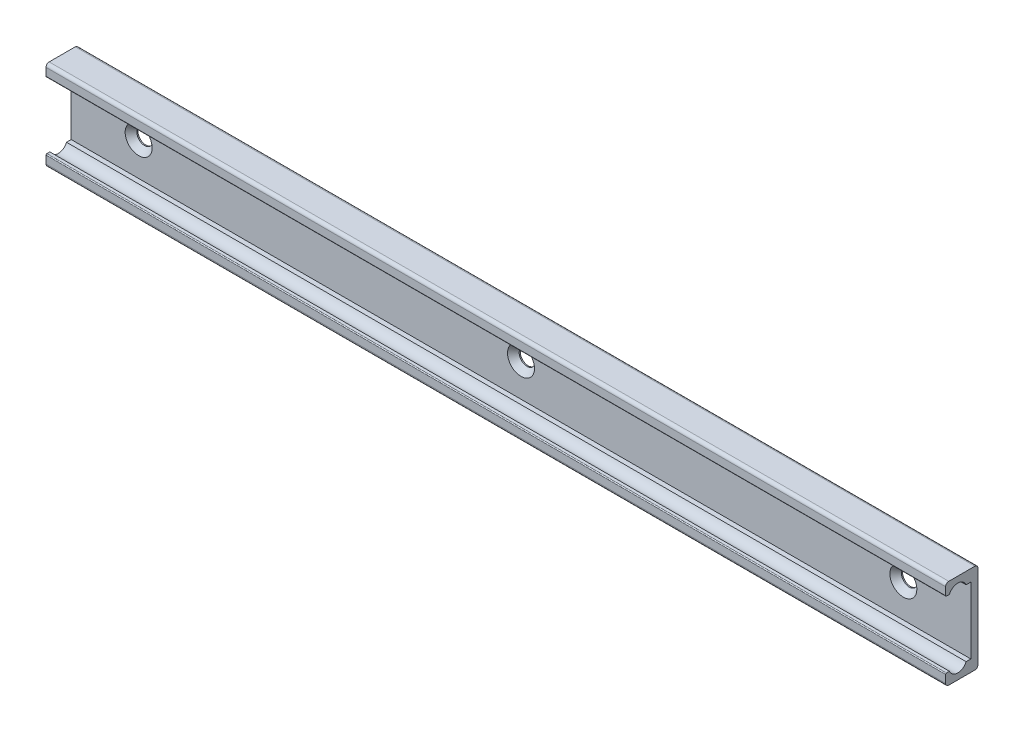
ISO-10303-21;
HEADER;
FILE_DESCRIPTION(('STEP AP214'),'2;1');
FILE_NAME('part.step','',(''),(''),'','','');
FILE_SCHEMA(('AUTOMOTIVE_DESIGN { 1 0 10303 214 1 1 1 1 }'));
ENDSEC;
DATA;
#1=APPLICATION_CONTEXT('core data for automotive mechanical design processes');
#2=APPLICATION_PROTOCOL_DEFINITION('international standard','automotive_design',2000,#1);
#3=PRODUCT_CONTEXT('',#1,'mechanical');
#4=PRODUCT('Part','Part','',(#3));
#5=PRODUCT_RELATED_PRODUCT_CATEGORY('part','',(#4));
#6=PRODUCT_DEFINITION_FORMATION('','',#4);
#7=PRODUCT_DEFINITION_CONTEXT('part definition',#1,'design');
#8=PRODUCT_DEFINITION('design','',#6,#7);
#9=PRODUCT_DEFINITION_SHAPE('','',#8);
#10=(LENGTH_UNIT() NAMED_UNIT(*) SI_UNIT(.MILLI.,.METRE.));
#11=(NAMED_UNIT(*) PLANE_ANGLE_UNIT() SI_UNIT($,.RADIAN.));
#12=(NAMED_UNIT(*) SI_UNIT($,.STERADIAN.) SOLID_ANGLE_UNIT());
#13=UNCERTAINTY_MEASURE_WITH_UNIT(LENGTH_MEASURE(1.E-05),#10,'distance_accuracy_value','');
#14=(GEOMETRIC_REPRESENTATION_CONTEXT(3) GLOBAL_UNCERTAINTY_ASSIGNED_CONTEXT((#13)) GLOBAL_UNIT_ASSIGNED_CONTEXT((#10,
#11,#12)) REPRESENTATION_CONTEXT('',''));
#15=CARTESIAN_POINT('',(0.,0.,0.));
#16=DIRECTION('',(0.,0.,1.));
#17=DIRECTION('',(1.,0.,0.));
#18=AXIS2_PLACEMENT_3D('',#15,#16,#17);
#19=CARTESIAN_POINT('',(185.,9.3,6.49999999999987));
#20=DIRECTION('',(-1.,0.,0.));
#21=DIRECTION('',(0.,0.,1.));
#22=AXIS2_PLACEMENT_3D('',#19,#20,#21);
#23=CYLINDRICAL_SURFACE('',#22,0.7);
#24=CARTESIAN_POINT('',(-15.,9.3,6.49999999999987));
#25=DIRECTION('',(-1.,0.,0.));
#26=DIRECTION('',(0.,0.,-1.));
#27=AXIS2_PLACEMENT_3D('',#24,#25,#26);
#28=CIRCLE('',#27,0.7);
#29=CARTESIAN_POINT('',(-15.,9.3,7.19999999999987));
#30=VERTEX_POINT('',#29);
#31=CARTESIAN_POINT('',(-15.,10.,6.49999999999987));
#32=VERTEX_POINT('',#31);
#33=EDGE_CURVE('E139',#30,#32,#28,.T.);
#34=ORIENTED_EDGE('',*,*,#33,.F.);
#35=DIRECTION('',(-1.,0.,0.));
#36=VECTOR('',#35,1.);
#37=CARTESIAN_POINT('',(185.,9.3,7.19999999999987));
#38=LINE('',#37,#36);
#39=CARTESIAN_POINT('',(185.,9.3,7.19999999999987));
#40=VERTEX_POINT('',#39);
#41=EDGE_CURVE('E9',#40,#30,#38,.T.);
#42=ORIENTED_EDGE('',*,*,#41,.F.);
#43=CARTESIAN_POINT('',(185.,9.3,6.49999999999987));
#44=DIRECTION('',(-1.,0.,0.));
#45=DIRECTION('',(0.,0.,-1.));
#46=AXIS2_PLACEMENT_3D('',#43,#44,#45);
#47=CIRCLE('',#46,0.7);
#48=CARTESIAN_POINT('',(185.,10.,6.49999999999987));
#49=VERTEX_POINT('',#48);
#50=EDGE_CURVE('E141',#40,#49,#47,.T.);
#51=ORIENTED_EDGE('',*,*,#50,.T.);
#52=DIRECTION('',(-1.,0.,0.));
#53=VECTOR('',#52,1.);
#54=CARTESIAN_POINT('',(185.,10.,6.49999999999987));
#55=LINE('',#54,#53);
#56=EDGE_CURVE('E136',#49,#32,#55,.T.);
#57=ORIENTED_EDGE('',*,*,#56,.T.);
#58=EDGE_LOOP('',(#34,#42,#51,#57));
#59=FACE_BOUND('',#58,.T.);
#60=ADVANCED_FACE('F14',(#59),#23,.T.);
#61=CARTESIAN_POINT('',(185.,7.60000008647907,7.19999999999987));
#62=DIRECTION('',(0.,0.,1.));
#63=DIRECTION('',(1.,0.,0.));
#64=AXIS2_PLACEMENT_3D('',#61,#62,#63);
#65=PLANE('',#64);
#66=DIRECTION('',(0.,1.,0.));
#67=VECTOR('',#66,1.);
#68=CARTESIAN_POINT('',(-15.,7.60000008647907,7.19999999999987));
#69=LINE('',#68,#67);
#70=CARTESIAN_POINT('',(-15.,7.60000008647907,7.19999999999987));
#71=VERTEX_POINT('',#70);
#72=EDGE_CURVE('E158',#71,#30,#69,.T.);
#73=ORIENTED_EDGE('',*,*,#72,.F.);
#74=DIRECTION('',(-1.,0.,0.));
#75=VECTOR('',#74,1.);
#76=CARTESIAN_POINT('',(185.,7.60000008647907,7.19999999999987));
#77=LINE('',#76,#75);
#78=CARTESIAN_POINT('',(185.,7.60000008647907,7.19999999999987));
#79=VERTEX_POINT('',#78);
#80=EDGE_CURVE('E22',#79,#71,#77,.T.);
#81=ORIENTED_EDGE('',*,*,#80,.F.);
#82=DIRECTION('',(0.,1.,0.));
#83=VECTOR('',#82,1.);
#84=CARTESIAN_POINT('',(185.,7.60000008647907,7.19999999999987));
#85=LINE('',#84,#83);
#86=EDGE_CURVE('E146',#79,#40,#85,.T.);
#87=ORIENTED_EDGE('',*,*,#86,.T.);
#88=ORIENTED_EDGE('',*,*,#41,.T.);
#89=EDGE_LOOP('',(#73,#81,#87,#88));
#90=FACE_BOUND('',#89,.T.);
#91=ADVANCED_FACE('F386',(#90),#65,.T.);
#92=CARTESIAN_POINT('',(185.,7.60000008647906,6.99999999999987));
#93=DIRECTION('',(-1.,0.,0.));
#94=DIRECTION('',(0.,0.,1.));
#95=AXIS2_PLACEMENT_3D('',#92,#93,#94);
#96=CYLINDRICAL_SURFACE('',#95,0.2);
#97=CARTESIAN_POINT('',(-15.,7.60000008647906,6.99999999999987));
#98=DIRECTION('',(-1.,0.,0.));
#99=DIRECTION('',(0.,0.,-1.));
#100=AXIS2_PLACEMENT_3D('',#97,#98,#99);
#101=CIRCLE('',#100,0.2);
#102=CARTESIAN_POINT('',(-15.,7.40000008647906,6.99999999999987));
#103=VERTEX_POINT('',#102);
#104=EDGE_CURVE('E206',#103,#71,#101,.T.);
#105=ORIENTED_EDGE('',*,*,#104,.F.);
#106=DIRECTION('',(-1.,0.,0.));
#107=VECTOR('',#106,1.);
#108=CARTESIAN_POINT('',(185.,7.40000008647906,6.99999999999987));
#109=LINE('',#108,#107);
#110=CARTESIAN_POINT('',(185.,7.40000008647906,6.99999999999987));
#111=VERTEX_POINT('',#110);
#112=EDGE_CURVE('E258',#111,#103,#109,.T.);
#113=ORIENTED_EDGE('',*,*,#112,.F.);
#114=CARTESIAN_POINT('',(185.,7.60000008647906,6.99999999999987));
#115=DIRECTION('',(-1.,0.,0.));
#116=DIRECTION('',(0.,0.,-1.));
#117=AXIS2_PLACEMENT_3D('',#114,#115,#116);
#118=CIRCLE('',#117,0.2);
#119=EDGE_CURVE('E254',#111,#79,#118,.T.);
#120=ORIENTED_EDGE('',*,*,#119,.T.);
#121=ORIENTED_EDGE('',*,*,#80,.T.);
#122=EDGE_LOOP('',(#105,#113,#120,#121));
#123=FACE_BOUND('',#122,.T.);
#124=ADVANCED_FACE('F391',(#123),#96,.T.);
#125=CARTESIAN_POINT('',(185.,7.40000008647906,6.35404949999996));
#126=DIRECTION('',(0.,-1.,0.));
#127=DIRECTION('',(1.,0.,0.));
#128=AXIS2_PLACEMENT_3D('',#125,#126,#127);
#129=PLANE('',#128);
#130=DIRECTION('',(0.,0.,1.));
#131=VECTOR('',#130,1.);
#132=CARTESIAN_POINT('',(-15.,7.40000008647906,6.35404949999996));
#133=LINE('',#132,#131);
#134=CARTESIAN_POINT('',(-15.,7.40000008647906,6.35404949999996));
#135=VERTEX_POINT('',#134);
#136=EDGE_CURVE('E203',#135,#103,#133,.T.);
#137=ORIENTED_EDGE('',*,*,#136,.F.);
#138=DIRECTION('',(-1.,0.,0.));
#139=VECTOR('',#138,1.);
#140=CARTESIAN_POINT('',(185.,7.40000008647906,6.35404949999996));
#141=LINE('',#140,#139);
#142=CARTESIAN_POINT('',(185.,7.40000008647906,6.35404949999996));
#143=VERTEX_POINT('',#142);
#144=EDGE_CURVE('E260',#143,#135,#141,.T.);
#145=ORIENTED_EDGE('',*,*,#144,.F.);
#146=DIRECTION('',(0.,0.,1.));
#147=VECTOR('',#146,1.);
#148=CARTESIAN_POINT('',(185.,7.40000008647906,6.35404949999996));
#149=LINE('',#148,#147);
#150=EDGE_CURVE('E251',#143,#111,#149,.T.);
#151=ORIENTED_EDGE('',*,*,#150,.T.);
#152=ORIENTED_EDGE('',*,*,#112,.T.);
#153=EDGE_LOOP('',(#137,#145,#151,#152));
#154=FACE_BOUND('',#153,.T.);
#155=ADVANCED_FACE('F397',(#154),#129,.T.);
#156=CARTESIAN_POINT('',(185.,6.65000008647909,4.50000000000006));
#157=DIRECTION('',(-1.,0.,0.));
#158=DIRECTION('',(0.,0.,1.));
#159=AXIS2_PLACEMENT_3D('',#156,#157,#158);
#160=CYLINDRICAL_SURFACE('',#159,1.99999988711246);
#161=CARTESIAN_POINT('',(-15.,6.65000008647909,4.50000000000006));
#162=DIRECTION('',(1.,0.,0.));
#163=DIRECTION('',(0.,0.,1.));
#164=AXIS2_PLACEMENT_3D('',#161,#162,#163);
#165=CIRCLE('',#164,1.99999988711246);
#166=CARTESIAN_POINT('',(-15.,7.40000008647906,2.64595050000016));
#167=VERTEX_POINT('',#166);
#168=EDGE_CURVE('E200',#167,#135,#165,.T.);
#169=ORIENTED_EDGE('',*,*,#168,.F.);
#170=DIRECTION('',(-1.,0.,0.));
#171=VECTOR('',#170,1.);
#172=CARTESIAN_POINT('',(185.,7.40000008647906,2.64595050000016));
#173=LINE('',#172,#171);
#174=CARTESIAN_POINT('',(185.,7.40000008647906,2.64595050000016));
#175=VERTEX_POINT('',#174);
#176=EDGE_CURVE('E262',#175,#167,#173,.T.);
#177=ORIENTED_EDGE('',*,*,#176,.F.);
#178=CARTESIAN_POINT('',(185.,6.65000008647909,4.50000000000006));
#179=DIRECTION('',(1.,0.,0.));
#180=DIRECTION('',(0.,0.,1.));
#181=AXIS2_PLACEMENT_3D('',#178,#179,#180);
#182=CIRCLE('',#181,1.99999988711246);
#183=EDGE_CURVE('E248',#175,#143,#182,.T.);
#184=ORIENTED_EDGE('',*,*,#183,.T.);
#185=ORIENTED_EDGE('',*,*,#144,.T.);
#186=EDGE_LOOP('',(#169,#177,#184,#185));
#187=FACE_BOUND('',#186,.T.);
#188=ADVANCED_FACE('F405',(#187),#160,.F.);
#189=CARTESIAN_POINT('',(185.,7.40000008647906,1.60000000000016));
#190=DIRECTION('',(0.,-1.,0.));
#191=DIRECTION('',(1.,0.,0.));
#192=AXIS2_PLACEMENT_3D('',#189,#190,#191);
#193=PLANE('',#192);
#194=DIRECTION('',(0.,0.,1.));
#195=VECTOR('',#194,1.);
#196=CARTESIAN_POINT('',(-15.,7.40000008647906,1.60000000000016));
#197=LINE('',#196,#195);
#198=CARTESIAN_POINT('',(-15.,7.40000008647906,1.60000000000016));
#199=VERTEX_POINT('',#198);
#200=EDGE_CURVE('E197',#199,#167,#197,.T.);
#201=ORIENTED_EDGE('',*,*,#200,.F.);
#202=DIRECTION('',(-1.,0.,0.));
#203=VECTOR('',#202,1.);
#204=CARTESIAN_POINT('',(185.,7.40000008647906,1.60000000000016));
#205=LINE('',#204,#203);
#206=CARTESIAN_POINT('',(185.,7.40000008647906,1.60000000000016));
#207=VERTEX_POINT('',#206);
#208=EDGE_CURVE('E264',#207,#199,#205,.T.);
#209=ORIENTED_EDGE('',*,*,#208,.F.);
#210=DIRECTION('',(0.,0.,1.));
#211=VECTOR('',#210,1.);
#212=CARTESIAN_POINT('',(185.,7.40000008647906,1.60000000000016));
#213=LINE('',#212,#211);
#214=EDGE_CURVE('E245',#207,#175,#213,.T.);
#215=ORIENTED_EDGE('',*,*,#214,.T.);
#216=ORIENTED_EDGE('',*,*,#176,.T.);
#217=EDGE_LOOP('',(#201,#209,#215,#216));
#218=FACE_BOUND('',#217,.T.);
#219=ADVANCED_FACE('F330',(#218),#193,.T.);
#220=CARTESIAN_POINT('',(185.,-7.40000008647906,1.60000000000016));
#221=DIRECTION('',(0.,0.,1.));
#222=DIRECTION('',(0.,1.,0.));
#223=AXIS2_PLACEMENT_3D('',#220,#221,#222);
#224=PLANE('',#223);
#225=CARTESIAN_POINT('',(170.,0.,1.60000000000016));
#226=DIRECTION('',(0.,0.,1.));
#227=DIRECTION('',(0.,1.,0.));
#228=AXIS2_PLACEMENT_3D('',#225,#226,#227);
#229=CIRCLE('',#228,3.);
#230=CARTESIAN_POINT('',(170.,3.,1.60000000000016));
#231=VERTEX_POINT('',#230);
#232=EDGE_CURVE('E291',#231,#231,#229,.T.);
#233=ORIENTED_EDGE('',*,*,#232,.F.);
#234=EDGE_LOOP('',(#233));
#235=FACE_BOUND('',#234,.T.);
#236=CARTESIAN_POINT('',(85.,0.,1.60000000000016));
#237=DIRECTION('',(0.,0.,1.));
#238=DIRECTION('',(0.,1.,0.));
#239=AXIS2_PLACEMENT_3D('',#236,#237,#238);
#240=CIRCLE('',#239,3.);
#241=CARTESIAN_POINT('',(85.,3.,1.60000000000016));
#242=VERTEX_POINT('',#241);
#243=EDGE_CURVE('E296',#242,#242,#240,.T.);
#244=ORIENTED_EDGE('',*,*,#243,.F.);
#245=EDGE_LOOP('',(#244));
#246=FACE_BOUND('',#245,.T.);
#247=CARTESIAN_POINT('',(0.,0.,1.60000000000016));
#248=DIRECTION('',(0.,0.,1.));
#249=DIRECTION('',(0.,1.,0.));
#250=AXIS2_PLACEMENT_3D('',#247,#248,#249);
#251=CIRCLE('',#250,3.);
#252=CARTESIAN_POINT('',(0.,3.,1.60000000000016));
#253=VERTEX_POINT('',#252);
#254=EDGE_CURVE('E159',#253,#253,#251,.T.);
#255=ORIENTED_EDGE('',*,*,#254,.F.);
#256=EDGE_LOOP('',(#255));
#257=FACE_BOUND('',#256,.T.);
#258=DIRECTION('',(0.,1.,0.));
#259=VECTOR('',#258,1.);
#260=CARTESIAN_POINT('',(-15.,-7.40000008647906,1.60000000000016));
#261=LINE('',#260,#259);
#262=CARTESIAN_POINT('',(-15.,-7.40000008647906,1.60000000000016));
#263=VERTEX_POINT('',#262);
#264=EDGE_CURVE('E194',#263,#199,#261,.T.);
#265=ORIENTED_EDGE('',*,*,#264,.F.);
#266=DIRECTION('',(-1.,0.,0.));
#267=VECTOR('',#266,1.);
#268=CARTESIAN_POINT('',(185.,-7.40000008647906,1.60000000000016));
#269=LINE('',#268,#267);
#270=CARTESIAN_POINT('',(185.,-7.40000008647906,1.60000000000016));
#271=VERTEX_POINT('',#270);
#272=EDGE_CURVE('E266',#271,#263,#269,.T.);
#273=ORIENTED_EDGE('',*,*,#272,.F.);
#274=DIRECTION('',(0.,1.,0.));
#275=VECTOR('',#274,1.);
#276=CARTESIAN_POINT('',(185.,-7.40000008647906,1.60000000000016));
#277=LINE('',#276,#275);
#278=EDGE_CURVE('E242',#271,#207,#277,.T.);
#279=ORIENTED_EDGE('',*,*,#278,.T.);
#280=ORIENTED_EDGE('',*,*,#208,.T.);
#281=EDGE_LOOP('',(#265,#273,#279,#280));
#282=FACE_BOUND('',#281,.T.);
#283=ADVANCED_FACE('F326',(#235,#246,#257,#282),#224,.T.);
#284=CARTESIAN_POINT('',(185.,-7.40000008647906,1.60000000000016));
#285=DIRECTION('',(0.,1.,0.));
#286=DIRECTION('',(-1.,0.,0.));
#287=AXIS2_PLACEMENT_3D('',#284,#285,#286);
#288=PLANE('',#287);
#289=DIRECTION('',(0.,0.,-1.));
#290=VECTOR('',#289,1.);
#291=CARTESIAN_POINT('',(-15.,-7.40000008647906,1.60000000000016));
#292=LINE('',#291,#290);
#293=CARTESIAN_POINT('',(-15.,-7.40000008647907,2.64595050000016));
#294=VERTEX_POINT('',#293);
#295=EDGE_CURVE('E191',#294,#263,#292,.T.);
#296=ORIENTED_EDGE('',*,*,#295,.F.);
#297=DIRECTION('',(-1.,0.,0.));
#298=VECTOR('',#297,1.);
#299=CARTESIAN_POINT('',(185.,-7.40000008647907,2.64595050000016));
#300=LINE('',#299,#298);
#301=CARTESIAN_POINT('',(185.,-7.40000008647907,2.64595050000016));
#302=VERTEX_POINT('',#301);
#303=EDGE_CURVE('E268',#302,#294,#300,.T.);
#304=ORIENTED_EDGE('',*,*,#303,.F.);
#305=DIRECTION('',(0.,0.,-1.));
#306=VECTOR('',#305,1.);
#307=CARTESIAN_POINT('',(185.,-7.40000008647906,1.60000000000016));
#308=LINE('',#307,#306);
#309=EDGE_CURVE('E239',#302,#271,#308,.T.);
#310=ORIENTED_EDGE('',*,*,#309,.T.);
#311=ORIENTED_EDGE('',*,*,#272,.T.);
#312=EDGE_LOOP('',(#296,#304,#310,#311));
#313=FACE_BOUND('',#312,.T.);
#314=ADVANCED_FACE('F329',(#313),#288,.T.);
#315=CARTESIAN_POINT('',(185.,-6.65000008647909,4.50000000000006));
#316=DIRECTION('',(-1.,0.,0.));
#317=DIRECTION('',(0.,0.,1.));
#318=AXIS2_PLACEMENT_3D('',#315,#316,#317);
#319=CYLINDRICAL_SURFACE('',#318,1.99999988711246);
#320=CARTESIAN_POINT('',(-15.,-6.65000008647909,4.50000000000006));
#321=DIRECTION('',(1.,0.,0.));
#322=DIRECTION('',(0.,0.,-1.));
#323=AXIS2_PLACEMENT_3D('',#320,#321,#322);
#324=CIRCLE('',#323,1.99999988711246);
#325=CARTESIAN_POINT('',(-15.,-7.40000008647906,6.35404949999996));
#326=VERTEX_POINT('',#325);
#327=EDGE_CURVE('E188',#326,#294,#324,.T.);
#328=ORIENTED_EDGE('',*,*,#327,.F.);
#329=DIRECTION('',(-1.,0.,0.));
#330=VECTOR('',#329,1.);
#331=CARTESIAN_POINT('',(185.,-7.40000008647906,6.35404949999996));
#332=LINE('',#331,#330);
#333=CARTESIAN_POINT('',(185.,-7.40000008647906,6.35404949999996));
#334=VERTEX_POINT('',#333);
#335=EDGE_CURVE('E270',#334,#326,#332,.T.);
#336=ORIENTED_EDGE('',*,*,#335,.F.);
#337=CARTESIAN_POINT('',(185.,-6.65000008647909,4.50000000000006));
#338=DIRECTION('',(1.,0.,0.));
#339=DIRECTION('',(0.,0.,-1.));
#340=AXIS2_PLACEMENT_3D('',#337,#338,#339);
#341=CIRCLE('',#340,1.99999988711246);
#342=EDGE_CURVE('E236',#334,#302,#341,.T.);
#343=ORIENTED_EDGE('',*,*,#342,.T.);
#344=ORIENTED_EDGE('',*,*,#303,.T.);
#345=EDGE_LOOP('',(#328,#336,#343,#344));
#346=FACE_BOUND('',#345,.T.);
#347=ADVANCED_FACE('F346',(#346),#319,.F.);
#348=CARTESIAN_POINT('',(185.,-7.40000008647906,6.35404949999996));
#349=DIRECTION('',(0.,1.,0.));
#350=DIRECTION('',(-1.,0.,0.));
#351=AXIS2_PLACEMENT_3D('',#348,#349,#350);
#352=PLANE('',#351);
#353=DIRECTION('',(0.,0.,-1.));
#354=VECTOR('',#353,1.);
#355=CARTESIAN_POINT('',(-15.,-7.40000008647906,6.35404949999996));
#356=LINE('',#355,#354);
#357=CARTESIAN_POINT('',(-15.,-7.40000008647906,6.99999999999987));
#358=VERTEX_POINT('',#357);
#359=EDGE_CURVE('E185',#358,#326,#356,.T.);
#360=ORIENTED_EDGE('',*,*,#359,.F.);
#361=DIRECTION('',(-1.,0.,0.));
#362=VECTOR('',#361,1.);
#363=CARTESIAN_POINT('',(185.,-7.40000008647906,6.99999999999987));
#364=LINE('',#363,#362);
#365=CARTESIAN_POINT('',(185.,-7.40000008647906,6.99999999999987));
#366=VERTEX_POINT('',#365);
#367=EDGE_CURVE('E272',#366,#358,#364,.T.);
#368=ORIENTED_EDGE('',*,*,#367,.F.);
#369=DIRECTION('',(0.,0.,-1.));
#370=VECTOR('',#369,1.);
#371=CARTESIAN_POINT('',(185.,-7.40000008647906,6.35404949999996));
#372=LINE('',#371,#370);
#373=EDGE_CURVE('E233',#366,#334,#372,.T.);
#374=ORIENTED_EDGE('',*,*,#373,.T.);
#375=ORIENTED_EDGE('',*,*,#335,.T.);
#376=EDGE_LOOP('',(#360,#368,#374,#375));
#377=FACE_BOUND('',#376,.T.);
#378=ADVANCED_FACE('F349',(#377),#352,.T.);
#379=CARTESIAN_POINT('',(185.,-7.60000008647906,6.99999999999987));
#380=DIRECTION('',(-1.,0.,0.));
#381=DIRECTION('',(0.,0.,1.));
#382=AXIS2_PLACEMENT_3D('',#379,#380,#381);
#383=CYLINDRICAL_SURFACE('',#382,0.2);
#384=CARTESIAN_POINT('',(-15.,-7.60000008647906,6.99999999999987));
#385=DIRECTION('',(-1.,0.,0.));
#386=DIRECTION('',(0.,0.,1.));
#387=AXIS2_PLACEMENT_3D('',#384,#385,#386);
#388=CIRCLE('',#387,0.2);
#389=CARTESIAN_POINT('',(-15.,-7.60000008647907,7.19999999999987));
#390=VERTEX_POINT('',#389);
#391=EDGE_CURVE('E182',#390,#358,#388,.T.);
#392=ORIENTED_EDGE('',*,*,#391,.F.);
#393=DIRECTION('',(-1.,0.,0.));
#394=VECTOR('',#393,1.);
#395=CARTESIAN_POINT('',(185.,-7.60000008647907,7.19999999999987));
#396=LINE('',#395,#394);
#397=CARTESIAN_POINT('',(185.,-7.60000008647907,7.19999999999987));
#398=VERTEX_POINT('',#397);
#399=EDGE_CURVE('E274',#398,#390,#396,.T.);
#400=ORIENTED_EDGE('',*,*,#399,.F.);
#401=CARTESIAN_POINT('',(185.,-7.60000008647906,6.99999999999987));
#402=DIRECTION('',(-1.,0.,0.));
#403=DIRECTION('',(0.,0.,1.));
#404=AXIS2_PLACEMENT_3D('',#401,#402,#403);
#405=CIRCLE('',#404,0.2);
#406=EDGE_CURVE('E230',#398,#366,#405,.T.);
#407=ORIENTED_EDGE('',*,*,#406,.T.);
#408=ORIENTED_EDGE('',*,*,#367,.T.);
#409=EDGE_LOOP('',(#392,#400,#407,#408));
#410=FACE_BOUND('',#409,.T.);
#411=ADVANCED_FACE('F354',(#410),#383,.T.);
#412=CARTESIAN_POINT('',(185.,-7.60000008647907,7.19999999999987));
#413=DIRECTION('',(0.,0.,1.));
#414=DIRECTION('',(1.,0.,0.));
#415=AXIS2_PLACEMENT_3D('',#412,#413,#414);
#416=PLANE('',#415);
#417=DIRECTION('',(0.,1.,0.));
#418=VECTOR('',#417,1.);
#419=CARTESIAN_POINT('',(-15.,-7.60000008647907,7.19999999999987));
#420=LINE('',#419,#418);
#421=CARTESIAN_POINT('',(-15.,-9.3,7.19999999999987));
#422=VERTEX_POINT('',#421);
#423=EDGE_CURVE('E179',#422,#390,#420,.T.);
#424=ORIENTED_EDGE('',*,*,#423,.F.);
#425=DIRECTION('',(-1.,0.,0.));
#426=VECTOR('',#425,1.);
#427=CARTESIAN_POINT('',(185.,-9.3,7.19999999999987));
#428=LINE('',#427,#426);
#429=CARTESIAN_POINT('',(185.,-9.3,7.19999999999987));
#430=VERTEX_POINT('',#429);
#431=EDGE_CURVE('E276',#430,#422,#428,.T.);
#432=ORIENTED_EDGE('',*,*,#431,.F.);
#433=DIRECTION('',(0.,1.,0.));
#434=VECTOR('',#433,1.);
#435=CARTESIAN_POINT('',(185.,-7.60000008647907,7.19999999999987));
#436=LINE('',#435,#434);
#437=EDGE_CURVE('E227',#430,#398,#436,.T.);
#438=ORIENTED_EDGE('',*,*,#437,.T.);
#439=ORIENTED_EDGE('',*,*,#399,.T.);
#440=EDGE_LOOP('',(#424,#432,#438,#439));
#441=FACE_BOUND('',#440,.T.);
#442=ADVANCED_FACE('F357',(#441),#416,.T.);
#443=CARTESIAN_POINT('',(185.,-9.3,6.49999999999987));
#444=DIRECTION('',(-1.,0.,0.));
#445=DIRECTION('',(0.,0.,1.));
#446=AXIS2_PLACEMENT_3D('',#443,#444,#445);
#447=CYLINDRICAL_SURFACE('',#446,0.7);
#448=CARTESIAN_POINT('',(-15.,-9.3,6.49999999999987));
#449=DIRECTION('',(-1.,0.,0.));
#450=DIRECTION('',(0.,0.,1.));
#451=AXIS2_PLACEMENT_3D('',#448,#449,#450);
#452=CIRCLE('',#451,0.7);
#453=CARTESIAN_POINT('',(-15.,-10.,6.49999999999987));
#454=VERTEX_POINT('',#453);
#455=EDGE_CURVE('E176',#454,#422,#452,.T.);
#456=ORIENTED_EDGE('',*,*,#455,.F.);
#457=DIRECTION('',(-1.,0.,0.));
#458=VECTOR('',#457,1.);
#459=CARTESIAN_POINT('',(185.,-10.,6.49999999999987));
#460=LINE('',#459,#458);
#461=CARTESIAN_POINT('',(185.,-10.,6.49999999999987));
#462=VERTEX_POINT('',#461);
#463=EDGE_CURVE('E278',#462,#454,#460,.T.);
#464=ORIENTED_EDGE('',*,*,#463,.F.);
#465=CARTESIAN_POINT('',(185.,-9.3,6.49999999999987));
#466=DIRECTION('',(-1.,0.,0.));
#467=DIRECTION('',(0.,0.,1.));
#468=AXIS2_PLACEMENT_3D('',#465,#466,#467);
#469=CIRCLE('',#468,0.7);
#470=EDGE_CURVE('E224',#462,#430,#469,.T.);
#471=ORIENTED_EDGE('',*,*,#470,.T.);
#472=ORIENTED_EDGE('',*,*,#431,.T.);
#473=EDGE_LOOP('',(#456,#464,#471,#472));
#474=FACE_BOUND('',#473,.T.);
#475=ADVANCED_FACE('F362',(#474),#447,.T.);
#476=CARTESIAN_POINT('',(185.,-10.,0.7));
#477=DIRECTION('',(0.,-1.,0.));
#478=DIRECTION('',(1.,0.,0.));
#479=AXIS2_PLACEMENT_3D('',#476,#477,#478);
#480=PLANE('',#479);
#481=DIRECTION('',(0.,0.,1.));
#482=VECTOR('',#481,1.);
#483=CARTESIAN_POINT('',(-15.,-10.,0.7));
#484=LINE('',#483,#482);
#485=CARTESIAN_POINT('',(-15.,-10.,0.7));
#486=VERTEX_POINT('',#485);
#487=EDGE_CURVE('E173',#486,#454,#484,.T.);
#488=ORIENTED_EDGE('',*,*,#487,.F.);
#489=DIRECTION('',(-1.,0.,0.));
#490=VECTOR('',#489,1.);
#491=CARTESIAN_POINT('',(185.,-10.,0.7));
#492=LINE('',#491,#490);
#493=CARTESIAN_POINT('',(185.,-10.,0.7));
#494=VERTEX_POINT('',#493);
#495=EDGE_CURVE('E280',#494,#486,#492,.T.);
#496=ORIENTED_EDGE('',*,*,#495,.F.);
#497=DIRECTION('',(0.,0.,1.));
#498=VECTOR('',#497,1.);
#499=CARTESIAN_POINT('',(185.,-10.,0.7));
#500=LINE('',#499,#498);
#501=EDGE_CURVE('E221',#494,#462,#500,.T.);
#502=ORIENTED_EDGE('',*,*,#501,.T.);
#503=ORIENTED_EDGE('',*,*,#463,.T.);
#504=EDGE_LOOP('',(#488,#496,#502,#503));
#505=FACE_BOUND('',#504,.T.);
#506=ADVANCED_FACE('F365',(#505),#480,.T.);
#507=CARTESIAN_POINT('',(185.,-9.3,0.7));
#508=DIRECTION('',(-1.,0.,0.));
#509=DIRECTION('',(0.,0.,1.));
#510=AXIS2_PLACEMENT_3D('',#507,#508,#509);
#511=CYLINDRICAL_SURFACE('',#510,0.7);
#512=CARTESIAN_POINT('',(-15.,-9.3,0.7));
#513=DIRECTION('',(-1.,0.,0.));
#514=DIRECTION('',(0.,0.,1.));
#515=AXIS2_PLACEMENT_3D('',#512,#513,#514);
#516=CIRCLE('',#515,0.7);
#517=CARTESIAN_POINT('',(-15.,-9.3,0.));
#518=VERTEX_POINT('',#517);
#519=EDGE_CURVE('E170',#518,#486,#516,.T.);
#520=ORIENTED_EDGE('',*,*,#519,.F.);
#521=DIRECTION('',(-1.,0.,0.));
#522=VECTOR('',#521,1.);
#523=CARTESIAN_POINT('',(185.,-9.3,0.));
#524=LINE('',#523,#522);
#525=CARTESIAN_POINT('',(185.,-9.3,0.));
#526=VERTEX_POINT('',#525);
#527=EDGE_CURVE('E282',#526,#518,#524,.T.);
#528=ORIENTED_EDGE('',*,*,#527,.F.);
#529=CARTESIAN_POINT('',(185.,-9.3,0.7));
#530=DIRECTION('',(-1.,0.,0.));
#531=DIRECTION('',(0.,0.,1.));
#532=AXIS2_PLACEMENT_3D('',#529,#530,#531);
#533=CIRCLE('',#532,0.7);
#534=EDGE_CURVE('E218',#526,#494,#533,.T.);
#535=ORIENTED_EDGE('',*,*,#534,.T.);
#536=ORIENTED_EDGE('',*,*,#495,.T.);
#537=EDGE_LOOP('',(#520,#528,#535,#536));
#538=FACE_BOUND('',#537,.T.);
#539=ADVANCED_FACE('F370',(#538),#511,.T.);
#540=CARTESIAN_POINT('',(185.,-9.3,0.));
#541=DIRECTION('',(0.,0.,-1.));
#542=DIRECTION('',(-1.,0.,0.));
#543=AXIS2_PLACEMENT_3D('',#540,#541,#542);
#544=PLANE('',#543);
#545=CARTESIAN_POINT('',(170.,0.,0.));
#546=DIRECTION('',(0.,0.,1.));
#547=DIRECTION('',(0.,1.,0.));
#548=AXIS2_PLACEMENT_3D('',#545,#546,#547);
#549=CIRCLE('',#548,1.75);
#550=CARTESIAN_POINT('',(170.,1.75,0.));
#551=VERTEX_POINT('',#550);
#552=EDGE_CURVE('E303',#551,#551,#549,.T.);
#553=ORIENTED_EDGE('',*,*,#552,.T.);
#554=EDGE_LOOP('',(#553));
#555=FACE_BOUND('',#554,.T.);
#556=CARTESIAN_POINT('',(85.,0.,0.));
#557=DIRECTION('',(0.,0.,1.));
#558=DIRECTION('',(0.,1.,0.));
#559=AXIS2_PLACEMENT_3D('',#556,#557,#558);
#560=CIRCLE('',#559,1.75);
#561=CARTESIAN_POINT('',(85.,1.75,0.));
#562=VERTEX_POINT('',#561);
#563=EDGE_CURVE('E292',#562,#562,#560,.T.);
#564=ORIENTED_EDGE('',*,*,#563,.T.);
#565=EDGE_LOOP('',(#564));
#566=FACE_BOUND('',#565,.T.);
#567=CARTESIAN_POINT('',(0.,0.,0.));
#568=DIRECTION('',(0.,0.,1.));
#569=DIRECTION('',(0.,1.,0.));
#570=AXIS2_PLACEMENT_3D('',#567,#568,#569);
#571=CIRCLE('',#570,1.75);
#572=CARTESIAN_POINT('',(0.,1.75,0.));
#573=VERTEX_POINT('',#572);
#574=EDGE_CURVE('E288',#573,#573,#571,.T.);
#575=ORIENTED_EDGE('',*,*,#574,.T.);
#576=EDGE_LOOP('',(#575));
#577=FACE_BOUND('',#576,.T.);
#578=DIRECTION('',(0.,-1.,0.));
#579=VECTOR('',#578,1.);
#580=CARTESIAN_POINT('',(-15.,-9.3,0.));
#581=LINE('',#580,#579);
#582=CARTESIAN_POINT('',(-15.,9.3,0.));
#583=VERTEX_POINT('',#582);
#584=EDGE_CURVE('E167',#583,#518,#581,.T.);
#585=ORIENTED_EDGE('',*,*,#584,.F.);
#586=DIRECTION('',(-1.,0.,0.));
#587=VECTOR('',#586,1.);
#588=CARTESIAN_POINT('',(185.,9.3,0.));
#589=LINE('',#588,#587);
#590=CARTESIAN_POINT('',(185.,9.3,0.));
#591=VERTEX_POINT('',#590);
#592=EDGE_CURVE('E284',#591,#583,#589,.T.);
#593=ORIENTED_EDGE('',*,*,#592,.F.);
#594=DIRECTION('',(0.,-1.,0.));
#595=VECTOR('',#594,1.);
#596=CARTESIAN_POINT('',(185.,-9.3,0.));
#597=LINE('',#596,#595);
#598=EDGE_CURVE('E215',#591,#526,#597,.T.);
#599=ORIENTED_EDGE('',*,*,#598,.T.);
#600=ORIENTED_EDGE('',*,*,#527,.T.);
#601=EDGE_LOOP('',(#585,#593,#599,#600));
#602=FACE_BOUND('',#601,.T.);
#603=ADVANCED_FACE('F310',(#555,#566,#577,#602),#544,.T.);
#604=CARTESIAN_POINT('',(185.,9.3,0.7));
#605=DIRECTION('',(-1.,0.,0.));
#606=DIRECTION('',(0.,0.,1.));
#607=AXIS2_PLACEMENT_3D('',#604,#605,#606);
#608=CYLINDRICAL_SURFACE('',#607,0.7);
#609=CARTESIAN_POINT('',(-15.,9.3,0.7));
#610=DIRECTION('',(-1.,0.,0.));
#611=DIRECTION('',(0.,0.,-1.));
#612=AXIS2_PLACEMENT_3D('',#609,#610,#611);
#613=CIRCLE('',#612,0.7);
#614=CARTESIAN_POINT('',(-15.,10.,0.7));
#615=VERTEX_POINT('',#614);
#616=EDGE_CURVE('E154',#615,#583,#613,.T.);
#617=ORIENTED_EDGE('',*,*,#616,.F.);
#618=DIRECTION('',(-1.,0.,0.));
#619=VECTOR('',#618,1.);
#620=CARTESIAN_POINT('',(185.,10.,0.7));
#621=LINE('',#620,#619);
#622=CARTESIAN_POINT('',(185.,10.,0.7));
#623=VERTEX_POINT('',#622);
#624=EDGE_CURVE('E145',#623,#615,#621,.T.);
#625=ORIENTED_EDGE('',*,*,#624,.F.);
#626=CARTESIAN_POINT('',(185.,9.3,0.7));
#627=DIRECTION('',(-1.,0.,0.));
#628=DIRECTION('',(0.,0.,-1.));
#629=AXIS2_PLACEMENT_3D('',#626,#627,#628);
#630=CIRCLE('',#629,0.7);
#631=EDGE_CURVE('E212',#623,#591,#630,.T.);
#632=ORIENTED_EDGE('',*,*,#631,.T.);
#633=ORIENTED_EDGE('',*,*,#592,.T.);
#634=EDGE_LOOP('',(#617,#625,#632,#633));
#635=FACE_BOUND('',#634,.T.);
#636=ADVANCED_FACE('F374',(#635),#608,.T.);
#637=CARTESIAN_POINT('',(185.,10.,0.7));
#638=DIRECTION('',(0.,1.,0.));
#639=DIRECTION('',(-1.,0.,0.));
#640=AXIS2_PLACEMENT_3D('',#637,#638,#639);
#641=PLANE('',#640);
#642=DIRECTION('',(0.,0.,-1.));
#643=VECTOR('',#642,1.);
#644=CARTESIAN_POINT('',(-15.,10.,0.7));
#645=LINE('',#644,#643);
#646=EDGE_CURVE('E149',#32,#615,#645,.T.);
#647=ORIENTED_EDGE('',*,*,#646,.F.);
#648=ORIENTED_EDGE('',*,*,#56,.F.);
#649=DIRECTION('',(0.,0.,-1.));
#650=VECTOR('',#649,1.);
#651=CARTESIAN_POINT('',(185.,10.,0.7));
#652=LINE('',#651,#650);
#653=EDGE_CURVE('E210',#49,#623,#652,.T.);
#654=ORIENTED_EDGE('',*,*,#653,.T.);
#655=ORIENTED_EDGE('',*,*,#624,.T.);
#656=EDGE_LOOP('',(#647,#648,#654,#655));
#657=FACE_BOUND('',#656,.T.);
#658=ADVANCED_FACE('F150',(#657),#641,.T.);
#659=CARTESIAN_POINT('',(185.,9.3,6.49999999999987));
#660=DIRECTION('',(1.,0.,0.));
#661=DIRECTION('',(0.,0.,-1.));
#662=AXIS2_PLACEMENT_3D('',#659,#660,#661);
#663=PLANE('',#662);
#664=ORIENTED_EDGE('',*,*,#50,.F.);
#665=ORIENTED_EDGE('',*,*,#86,.F.);
#666=ORIENTED_EDGE('',*,*,#119,.F.);
#667=ORIENTED_EDGE('',*,*,#150,.F.);
#668=ORIENTED_EDGE('',*,*,#183,.F.);
#669=ORIENTED_EDGE('',*,*,#214,.F.);
#670=ORIENTED_EDGE('',*,*,#278,.F.);
#671=ORIENTED_EDGE('',*,*,#309,.F.);
#672=ORIENTED_EDGE('',*,*,#342,.F.);
#673=ORIENTED_EDGE('',*,*,#373,.F.);
#674=ORIENTED_EDGE('',*,*,#406,.F.);
#675=ORIENTED_EDGE('',*,*,#437,.F.);
#676=ORIENTED_EDGE('',*,*,#470,.F.);
#677=ORIENTED_EDGE('',*,*,#501,.F.);
#678=ORIENTED_EDGE('',*,*,#534,.F.);
#679=ORIENTED_EDGE('',*,*,#598,.F.);
#680=ORIENTED_EDGE('',*,*,#631,.F.);
#681=ORIENTED_EDGE('',*,*,#653,.F.);
#682=EDGE_LOOP('',(#664,#665,#666,#667,#668,#669,#670,#671,#672,#673,#674,#675,#676,#677,#678,
#679,#680,#681));
#683=FACE_BOUND('',#682,.T.);
#684=ADVANCED_FACE('F342',(#683),#663,.T.);
#685=CARTESIAN_POINT('',(-15.,9.3,6.49999999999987));
#686=DIRECTION('',(1.,0.,0.));
#687=DIRECTION('',(0.,0.,-1.));
#688=AXIS2_PLACEMENT_3D('',#685,#686,#687);
#689=PLANE('',#688);
#690=ORIENTED_EDGE('',*,*,#33,.T.);
#691=ORIENTED_EDGE('',*,*,#646,.T.);
#692=ORIENTED_EDGE('',*,*,#616,.T.);
#693=ORIENTED_EDGE('',*,*,#584,.T.);
#694=ORIENTED_EDGE('',*,*,#519,.T.);
#695=ORIENTED_EDGE('',*,*,#487,.T.);
#696=ORIENTED_EDGE('',*,*,#455,.T.);
#697=ORIENTED_EDGE('',*,*,#423,.T.);
#698=ORIENTED_EDGE('',*,*,#391,.T.);
#699=ORIENTED_EDGE('',*,*,#359,.T.);
#700=ORIENTED_EDGE('',*,*,#327,.T.);
#701=ORIENTED_EDGE('',*,*,#295,.T.);
#702=ORIENTED_EDGE('',*,*,#264,.T.);
#703=ORIENTED_EDGE('',*,*,#200,.T.);
#704=ORIENTED_EDGE('',*,*,#168,.T.);
#705=ORIENTED_EDGE('',*,*,#136,.T.);
#706=ORIENTED_EDGE('',*,*,#104,.T.);
#707=ORIENTED_EDGE('',*,*,#72,.T.);
#708=EDGE_LOOP('',(#690,#691,#692,#693,#694,#695,#696,#697,#698,#699,#700,#701,#702,#703,#704,
#705,#706,#707));
#709=FACE_BOUND('',#708,.T.);
#710=ADVANCED_FACE('F156',(#709),#689,.F.);
#711=CARTESIAN_POINT('',(0.,0.,1.60000000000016));
#712=DIRECTION('',(0.,0.,1.));
#713=DIRECTION('',(0.,1.,0.));
#714=AXIS2_PLACEMENT_3D('',#711,#712,#713);
#715=CONICAL_SURFACE('',#714,3.,0.750491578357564);
#716=CARTESIAN_POINT('',(0.,0.,0.259539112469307));
#717=DIRECTION('',(0.,0.,1.));
#718=DIRECTION('',(0.,1.,0.));
#719=AXIS2_PLACEMENT_3D('',#716,#717,#718);
#720=CIRCLE('',#719,1.75);
#721=CARTESIAN_POINT('',(0.,1.75,0.259539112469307));
#722=VERTEX_POINT('',#721);
#723=EDGE_CURVE('E162',#722,#722,#720,.F.);
#724=ORIENTED_EDGE('',*,*,#723,.T.);
#725=EDGE_LOOP('',(#724));
#726=FACE_BOUND('',#725,.T.);
#727=ORIENTED_EDGE('',*,*,#254,.T.);
#728=EDGE_LOOP('',(#727));
#729=FACE_BOUND('',#728,.T.);
#730=ADVANCED_FACE('F317',(#726,#729),#715,.F.);
#731=CARTESIAN_POINT('',(0.,0.,0.));
#732=DIRECTION('',(0.,0.,1.));
#733=DIRECTION('',(0.,1.,0.));
#734=AXIS2_PLACEMENT_3D('',#731,#732,#733);
#735=CYLINDRICAL_SURFACE('',#734,1.75);
#736=ORIENTED_EDGE('',*,*,#574,.F.);
#737=EDGE_LOOP('',(#736));
#738=FACE_BOUND('',#737,.T.);
#739=ORIENTED_EDGE('',*,*,#723,.F.);
#740=EDGE_LOOP('',(#739));
#741=FACE_BOUND('',#740,.T.);
#742=ADVANCED_FACE('F313',(#738,#741),#735,.F.);
#743=CARTESIAN_POINT('',(85.,0.,1.60000000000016));
#744=DIRECTION('',(0.,0.,1.));
#745=DIRECTION('',(0.,1.,0.));
#746=AXIS2_PLACEMENT_3D('',#743,#744,#745);
#747=CONICAL_SURFACE('',#746,3.,0.750491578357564);
#748=CARTESIAN_POINT('',(85.,0.,0.259539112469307));
#749=DIRECTION('',(0.,0.,1.));
#750=DIRECTION('',(0.,1.,0.));
#751=AXIS2_PLACEMENT_3D('',#748,#749,#750);
#752=CIRCLE('',#751,1.75);
#753=CARTESIAN_POINT('',(85.,1.75,0.259539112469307));
#754=VERTEX_POINT('',#753);
#755=EDGE_CURVE('E289',#754,#754,#752,.F.);
#756=ORIENTED_EDGE('',*,*,#755,.T.);
#757=EDGE_LOOP('',(#756));
#758=FACE_BOUND('',#757,.T.);
#759=ORIENTED_EDGE('',*,*,#243,.T.);
#760=EDGE_LOOP('',(#759));
#761=FACE_BOUND('',#760,.T.);
#762=ADVANCED_FACE('F316',(#758,#761),#747,.F.);
#763=CARTESIAN_POINT('',(170.,0.,1.60000000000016));
#764=DIRECTION('',(0.,0.,1.));
#765=DIRECTION('',(0.,1.,0.));
#766=AXIS2_PLACEMENT_3D('',#763,#764,#765);
#767=CONICAL_SURFACE('',#766,3.,0.750491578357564);
#768=CARTESIAN_POINT('',(170.,0.,0.259539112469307));
#769=DIRECTION('',(0.,0.,1.));
#770=DIRECTION('',(0.,1.,0.));
#771=AXIS2_PLACEMENT_3D('',#768,#769,#770);
#772=CIRCLE('',#771,1.75);
#773=CARTESIAN_POINT('',(170.,1.75,0.259539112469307));
#774=VERTEX_POINT('',#773);
#775=EDGE_CURVE('E17',#774,#774,#772,.F.);
#776=ORIENTED_EDGE('',*,*,#775,.T.);
#777=EDGE_LOOP('',(#776));
#778=FACE_BOUND('',#777,.T.);
#779=ORIENTED_EDGE('',*,*,#232,.T.);
#780=EDGE_LOOP('',(#779));
#781=FACE_BOUND('',#780,.T.);
#782=ADVANCED_FACE('F555',(#778,#781),#767,.F.);
#783=CARTESIAN_POINT('',(85.,0.,0.));
#784=DIRECTION('',(0.,0.,1.));
#785=DIRECTION('',(0.,1.,0.));
#786=AXIS2_PLACEMENT_3D('',#783,#784,#785);
#787=CYLINDRICAL_SURFACE('',#786,1.75);
#788=ORIENTED_EDGE('',*,*,#563,.F.);
#789=EDGE_LOOP('',(#788));
#790=FACE_BOUND('',#789,.T.);
#791=ORIENTED_EDGE('',*,*,#755,.F.);
#792=EDGE_LOOP('',(#791));
#793=FACE_BOUND('',#792,.T.);
#794=ADVANCED_FACE('F562',(#790,#793),#787,.F.);
#795=CARTESIAN_POINT('',(170.,0.,0.));
#796=DIRECTION('',(0.,0.,1.));
#797=DIRECTION('',(0.,1.,0.));
#798=AXIS2_PLACEMENT_3D('',#795,#796,#797);
#799=CYLINDRICAL_SURFACE('',#798,1.75);
#800=ORIENTED_EDGE('',*,*,#552,.F.);
#801=EDGE_LOOP('',(#800));
#802=FACE_BOUND('',#801,.T.);
#803=ORIENTED_EDGE('',*,*,#775,.F.);
#804=EDGE_LOOP('',(#803));
#805=FACE_BOUND('',#804,.T.);
#806=ADVANCED_FACE('F570',(#802,#805),#799,.F.);
#807=CLOSED_SHELL('',(#60,#91,#124,#155,#188,#219,#283,#314,#347,#378,#411,#442,#475,#506,#539,
#603,#636,#658,#684,#710,#730,#742,#762,#782,#794,#806));
#808=MANIFOLD_SOLID_BREP('B1',#807);
#809=ADVANCED_BREP_SHAPE_REPRESENTATION('',(#18,#808),#14);
#810=SHAPE_DEFINITION_REPRESENTATION(#9,#809);
ENDSEC;
END-ISO-10303-21;
